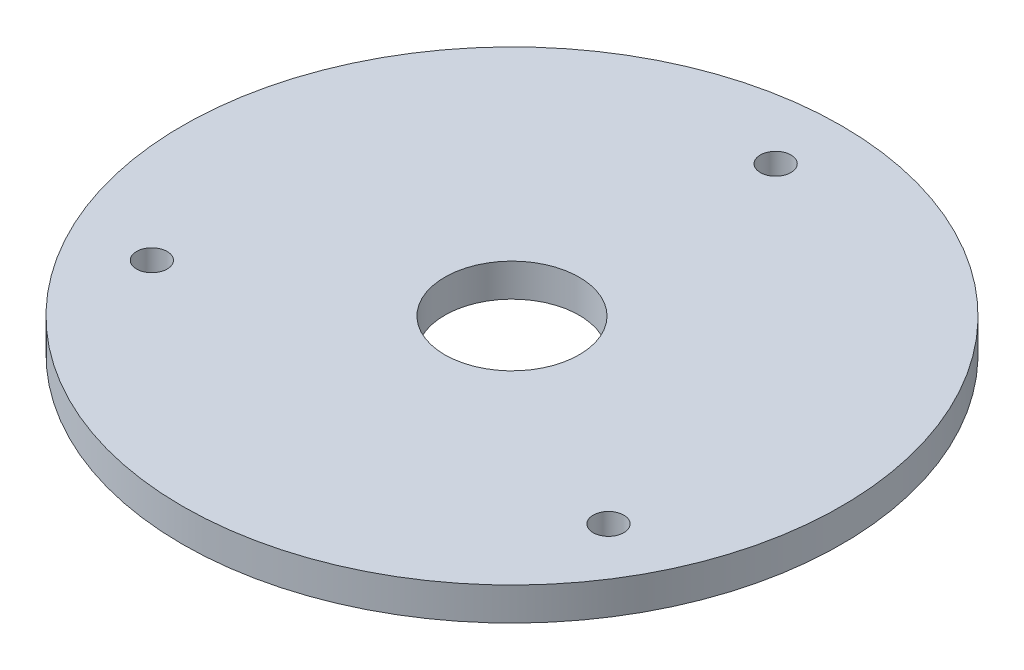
ISO-10303-21;
HEADER;
FILE_DESCRIPTION(('STEP AP214'),'2;1');
FILE_NAME('part.step','',(''),(''),'','','');
FILE_SCHEMA(('AUTOMOTIVE_DESIGN { 1 0 10303 214 1 1 1 1 }'));
ENDSEC;
DATA;
#1=APPLICATION_CONTEXT('core data for automotive mechanical design processes');
#2=APPLICATION_PROTOCOL_DEFINITION('international standard','automotive_design',2000,#1);
#3=PRODUCT_CONTEXT('',#1,'mechanical');
#4=PRODUCT('Part','Part','',(#3));
#5=PRODUCT_RELATED_PRODUCT_CATEGORY('part','',(#4));
#6=PRODUCT_DEFINITION_FORMATION('','',#4);
#7=PRODUCT_DEFINITION_CONTEXT('part definition',#1,'design');
#8=PRODUCT_DEFINITION('design','',#6,#7);
#9=PRODUCT_DEFINITION_SHAPE('','',#8);
#10=(LENGTH_UNIT() NAMED_UNIT(*) SI_UNIT(.MILLI.,.METRE.));
#11=(NAMED_UNIT(*) PLANE_ANGLE_UNIT() SI_UNIT($,.RADIAN.));
#12=(NAMED_UNIT(*) SI_UNIT($,.STERADIAN.) SOLID_ANGLE_UNIT());
#13=UNCERTAINTY_MEASURE_WITH_UNIT(LENGTH_MEASURE(1.E-05),#10,'distance_accuracy_value','');
#14=(GEOMETRIC_REPRESENTATION_CONTEXT(3) GLOBAL_UNCERTAINTY_ASSIGNED_CONTEXT((#13)) GLOBAL_UNIT_ASSIGNED_CONTEXT((#10,
#11,#12)) REPRESENTATION_CONTEXT('',''));
#15=CARTESIAN_POINT('',(0.,0.,0.));
#16=DIRECTION('',(0.,0.,1.));
#17=DIRECTION('',(1.,0.,0.));
#18=AXIS2_PLACEMENT_3D('',#15,#16,#17);
#19=CARTESIAN_POINT('',(0.,3.175,0.));
#20=DIRECTION('',(0.,1.,0.));
#21=DIRECTION('',(0.,0.,1.));
#22=AXIS2_PLACEMENT_3D('',#19,#20,#21);
#23=PLANE('',#22);
#24=CARTESIAN_POINT('',(-21.9970452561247,3.175,12.7));
#25=DIRECTION('',(0.,1.,0.));
#26=DIRECTION('',(0.,0.,1.));
#27=AXIS2_PLACEMENT_3D('',#24,#25,#26);
#28=CIRCLE('',#27,1.47320000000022);
#29=CARTESIAN_POINT('',(-21.9970452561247,3.175,14.1732000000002));
#30=VERTEX_POINT('',#29);
#31=EDGE_CURVE('E60',#30,#30,#28,.T.);
#32=ORIENTED_EDGE('',*,*,#31,.F.);
#33=EDGE_LOOP('',(#32));
#34=FACE_BOUND('',#33,.T.);
#35=CARTESIAN_POINT('',(21.9970452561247,3.175,12.7));
#36=DIRECTION('',(0.,1.,0.));
#37=DIRECTION('',(0.,0.,1.));
#38=AXIS2_PLACEMENT_3D('',#35,#36,#37);
#39=CIRCLE('',#38,1.47320000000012);
#40=CARTESIAN_POINT('',(21.9970452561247,3.175,14.1732000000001));
#41=VERTEX_POINT('',#40);
#42=EDGE_CURVE('E54',#41,#41,#39,.T.);
#43=ORIENTED_EDGE('',*,*,#42,.F.);
#44=EDGE_LOOP('',(#43));
#45=FACE_BOUND('',#44,.T.);
#46=CARTESIAN_POINT('',(0.,3.175,-25.4));
#47=DIRECTION('',(0.,1.,0.));
#48=DIRECTION('',(0.,0.,1.));
#49=AXIS2_PLACEMENT_3D('',#46,#47,#48);
#50=CIRCLE('',#49,1.4732);
#51=CARTESIAN_POINT('',(0.,3.175,-23.9268));
#52=VERTEX_POINT('',#51);
#53=EDGE_CURVE('E48',#52,#52,#50,.T.);
#54=ORIENTED_EDGE('',*,*,#53,.F.);
#55=EDGE_LOOP('',(#54));
#56=FACE_BOUND('',#55,.T.);
#57=CARTESIAN_POINT('',(0.,3.175,0.));
#58=DIRECTION('',(0.,1.,0.));
#59=DIRECTION('',(0.,0.,1.));
#60=AXIS2_PLACEMENT_3D('',#57,#58,#59);
#61=CIRCLE('',#60,31.75);
#62=CARTESIAN_POINT('',(0.,3.175,31.75));
#63=VERTEX_POINT('',#62);
#64=EDGE_CURVE('E10',#63,#63,#61,.T.);
#65=ORIENTED_EDGE('',*,*,#64,.T.);
#66=EDGE_LOOP('',(#65));
#67=FACE_BOUND('',#66,.T.);
#68=CARTESIAN_POINT('',(0.,3.175,0.));
#69=DIRECTION('',(0.,1.,0.));
#70=DIRECTION('',(0.,0.,1.));
#71=AXIS2_PLACEMENT_3D('',#68,#69,#70);
#72=CIRCLE('',#71,6.477);
#73=CARTESIAN_POINT('',(0.,3.175,6.477));
#74=VERTEX_POINT('',#73);
#75=EDGE_CURVE('E40',#74,#74,#72,.T.);
#76=ORIENTED_EDGE('',*,*,#75,.F.);
#77=EDGE_LOOP('',(#76));
#78=FACE_BOUND('',#77,.T.);
#79=ADVANCED_FACE('F29',(#34,#45,#56,#67,#78),#23,.T.);
#80=CARTESIAN_POINT('',(0.,0.,0.));
#81=DIRECTION('',(0.,1.,0.));
#82=DIRECTION('',(0.,0.,1.));
#83=AXIS2_PLACEMENT_3D('',#80,#81,#82);
#84=PLANE('',#83);
#85=CARTESIAN_POINT('',(-21.9970452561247,0.,12.7));
#86=DIRECTION('',(0.,1.,0.));
#87=DIRECTION('',(0.,0.,1.));
#88=AXIS2_PLACEMENT_3D('',#85,#86,#87);
#89=CIRCLE('',#88,1.47320000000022);
#90=CARTESIAN_POINT('',(-21.9970452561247,0.,14.1732000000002));
#91=VERTEX_POINT('',#90);
#92=EDGE_CURVE('E57',#91,#91,#89,.T.);
#93=ORIENTED_EDGE('',*,*,#92,.T.);
#94=EDGE_LOOP('',(#93));
#95=FACE_BOUND('',#94,.T.);
#96=CARTESIAN_POINT('',(21.9970452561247,0.,12.7));
#97=DIRECTION('',(0.,1.,0.));
#98=DIRECTION('',(0.,0.,1.));
#99=AXIS2_PLACEMENT_3D('',#96,#97,#98);
#100=CIRCLE('',#99,1.47320000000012);
#101=CARTESIAN_POINT('',(21.9970452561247,0.,14.1732000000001));
#102=VERTEX_POINT('',#101);
#103=EDGE_CURVE('E51',#102,#102,#100,.T.);
#104=ORIENTED_EDGE('',*,*,#103,.T.);
#105=EDGE_LOOP('',(#104));
#106=FACE_BOUND('',#105,.T.);
#107=CARTESIAN_POINT('',(0.,0.,-25.4));
#108=DIRECTION('',(0.,1.,0.));
#109=DIRECTION('',(0.,0.,1.));
#110=AXIS2_PLACEMENT_3D('',#107,#108,#109);
#111=CIRCLE('',#110,1.4732);
#112=CARTESIAN_POINT('',(0.,0.,-23.9268));
#113=VERTEX_POINT('',#112);
#114=EDGE_CURVE('E45',#113,#113,#111,.T.);
#115=ORIENTED_EDGE('',*,*,#114,.T.);
#116=EDGE_LOOP('',(#115));
#117=FACE_BOUND('',#116,.T.);
#118=CARTESIAN_POINT('',(0.,0.,0.));
#119=DIRECTION('',(0.,1.,0.));
#120=DIRECTION('',(0.,0.,1.));
#121=AXIS2_PLACEMENT_3D('',#118,#119,#120);
#122=CIRCLE('',#121,31.75);
#123=CARTESIAN_POINT('',(0.,0.,31.75));
#124=VERTEX_POINT('',#123);
#125=EDGE_CURVE('E33',#124,#124,#122,.T.);
#126=ORIENTED_EDGE('',*,*,#125,.F.);
#127=EDGE_LOOP('',(#126));
#128=FACE_BOUND('',#127,.T.);
#129=CARTESIAN_POINT('',(0.,0.,0.));
#130=DIRECTION('',(0.,1.,0.));
#131=DIRECTION('',(0.,0.,1.));
#132=AXIS2_PLACEMENT_3D('',#129,#130,#131);
#133=CIRCLE('',#132,6.477);
#134=CARTESIAN_POINT('',(0.,0.,6.477));
#135=VERTEX_POINT('',#134);
#136=EDGE_CURVE('E42',#135,#135,#133,.T.);
#137=ORIENTED_EDGE('',*,*,#136,.T.);
#138=EDGE_LOOP('',(#137));
#139=FACE_BOUND('',#138,.T.);
#140=ADVANCED_FACE('F66',(#95,#106,#117,#128,#139),#84,.F.);
#141=CARTESIAN_POINT('',(0.,3.175,0.));
#142=DIRECTION('',(0.,-1.,0.));
#143=DIRECTION('',(0.,0.,-1.));
#144=AXIS2_PLACEMENT_3D('',#141,#142,#143);
#145=CYLINDRICAL_SURFACE('',#144,31.75);
#146=ORIENTED_EDGE('',*,*,#64,.F.);
#147=EDGE_LOOP('',(#146));
#148=FACE_BOUND('',#147,.T.);
#149=ORIENTED_EDGE('',*,*,#125,.T.);
#150=EDGE_LOOP('',(#149));
#151=FACE_BOUND('',#150,.T.);
#152=ADVANCED_FACE('F31',(#148,#151),#145,.T.);
#153=CARTESIAN_POINT('',(0.,3.175,0.));
#154=DIRECTION('',(0.,-1.,0.));
#155=DIRECTION('',(0.,0.,-1.));
#156=AXIS2_PLACEMENT_3D('',#153,#154,#155);
#157=CYLINDRICAL_SURFACE('',#156,6.477);
#158=ORIENTED_EDGE('',*,*,#75,.T.);
#159=EDGE_LOOP('',(#158));
#160=FACE_BOUND('',#159,.T.);
#161=ORIENTED_EDGE('',*,*,#136,.F.);
#162=EDGE_LOOP('',(#161));
#163=FACE_BOUND('',#162,.T.);
#164=ADVANCED_FACE('F85',(#160,#163),#157,.F.);
#165=CARTESIAN_POINT('',(0.,0.,-25.4));
#166=DIRECTION('',(0.,1.,0.));
#167=DIRECTION('',(0.,0.,1.));
#168=AXIS2_PLACEMENT_3D('',#165,#166,#167);
#169=CYLINDRICAL_SURFACE('',#168,1.4732);
#170=ORIENTED_EDGE('',*,*,#114,.F.);
#171=EDGE_LOOP('',(#170));
#172=FACE_BOUND('',#171,.T.);
#173=ORIENTED_EDGE('',*,*,#53,.T.);
#174=EDGE_LOOP('',(#173));
#175=FACE_BOUND('',#174,.T.);
#176=ADVANCED_FACE('F88',(#172,#175),#169,.F.);
#177=CARTESIAN_POINT('',(21.9970452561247,0.,12.7));
#178=DIRECTION('',(0.,1.,0.));
#179=DIRECTION('',(0.,0.,1.));
#180=AXIS2_PLACEMENT_3D('',#177,#178,#179);
#181=CYLINDRICAL_SURFACE('',#180,1.47320000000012);
#182=ORIENTED_EDGE('',*,*,#103,.F.);
#183=EDGE_LOOP('',(#182));
#184=FACE_BOUND('',#183,.T.);
#185=ORIENTED_EDGE('',*,*,#42,.T.);
#186=EDGE_LOOP('',(#185));
#187=FACE_BOUND('',#186,.T.);
#188=ADVANCED_FACE('F72',(#184,#187),#181,.F.);
#189=CARTESIAN_POINT('',(-21.9970452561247,0.,12.7));
#190=DIRECTION('',(0.,1.,0.));
#191=DIRECTION('',(0.,0.,1.));
#192=AXIS2_PLACEMENT_3D('',#189,#190,#191);
#193=CYLINDRICAL_SURFACE('',#192,1.47320000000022);
#194=ORIENTED_EDGE('',*,*,#92,.F.);
#195=EDGE_LOOP('',(#194));
#196=FACE_BOUND('',#195,.T.);
#197=ORIENTED_EDGE('',*,*,#31,.T.);
#198=EDGE_LOOP('',(#197));
#199=FACE_BOUND('',#198,.T.);
#200=ADVANCED_FACE('F69',(#196,#199),#193,.F.);
#201=CLOSED_SHELL('',(#79,#140,#152,#164,#176,#188,#200));
#202=MANIFOLD_SOLID_BREP('B2',#201);
#203=ADVANCED_BREP_SHAPE_REPRESENTATION('',(#18,#202),#14);
#204=SHAPE_DEFINITION_REPRESENTATION(#9,#203);
ENDSEC;
END-ISO-10303-21;
